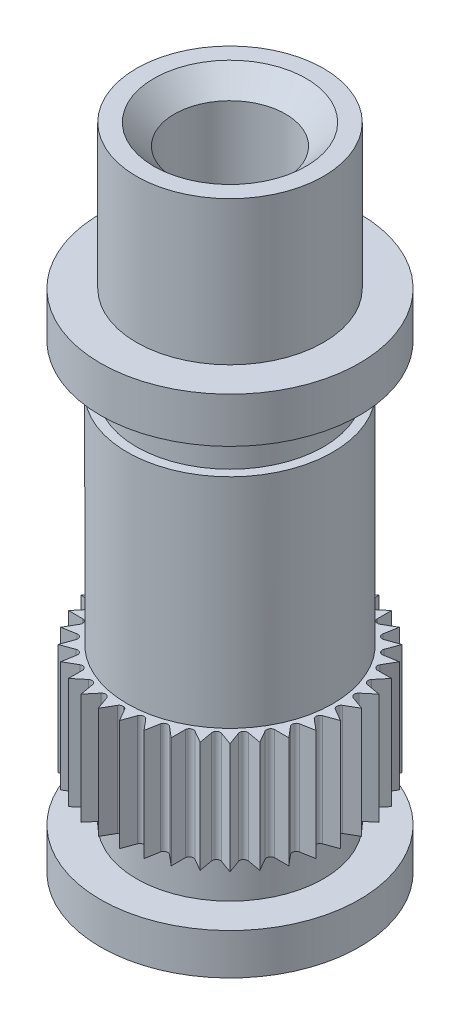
from build123d import *

# Parameters (mm, degrees)
BOSS_EXTRUDE1_DEPTH              = 2.7
F_36_0_1065_DIAMETER_HOLE1_D     = 2.7051
F_36_0_1065_DIAMETER_HOLE1_DEPTH = 9.525
F_36_0_1065_DIAMETER_HOLE1_TIP   = 0.81269403
CHAMFER1_SIZE                    = 0.500050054


with BuildPart() as part:
    # Sketch1 → Boss-Extrude1 (new body)
    with BuildSketch(Plane.XZ.offset(-2.1)):
        with BuildLine():
            Line((0.08660254, -2.65), (0.257785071, -2.94649684))
            Line((0.257785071, -2.94649684), (0.374880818, -2.624778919))
            ThreePointArc((0.374880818, -2.624778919), (0.451485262, -2.560500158), (0.545454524, -2.594702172))
            Line((0.545454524, -2.594702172), (0.765522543, -2.856969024))
            Line((0.765522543, -2.856969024), (0.824973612, -2.519805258))
            ThreePointArc((0.824973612, -2.519805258), (0.889252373, -2.443200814), (0.987733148, -2.460565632))
            Line((0.987733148, -2.460565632), (1.25, -2.680633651))
            Line((1.25, -2.680633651), (1.25, -2.33826859))
            ThreePointArc((1.25, -2.33826859), (1.3, -2.25166605), (1.4, -2.25166605))
            Line((1.4, -2.25166605), (1.69649684, -2.42284858))
            Line((1.69649684, -2.42284858), (1.637045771, -2.085684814))
            ThreePointArc((1.637045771, -2.085684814), (1.671247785, -1.991715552), (1.76972856, -1.974350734))
            Line((1.76972856, -1.974350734), (2.091446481, -2.091446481))
            Line((2.091446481, -2.091446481), (1.974350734, -1.76972856))
            ThreePointArc((1.974350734, -1.76972856), (1.991715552, -1.671247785), (2.085684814, -1.637045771))
            Line((2.085684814, -1.637045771), (2.42284858, -1.69649684))
            Line((2.42284858, -1.69649684), (2.25166605, -1.4))
            ThreePointArc((2.25166605, -1.4), (2.25166605, -1.3), (2.33826859, -1.25))
            Line((2.33826859, -1.25), (2.680633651, -1.25))
            Line((2.680633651, -1.25), (2.460565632, -0.987733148))
            ThreePointArc((2.460565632, -0.987733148), (2.443200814, -0.889252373), (2.519805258, -0.824973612))
            Line((2.519805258, -0.824973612), (2.856969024, -0.765522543))
            Line((2.856969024, -0.765522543), (2.594702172, -0.545454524))
            ThreePointArc((2.594702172, -0.545454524), (2.560500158, -0.451485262), (2.624778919, -0.374880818))
            Line((2.624778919, -0.374880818), (2.94649684, -0.257785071))
            Line((2.94649684, -0.257785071), (2.65, -0.08660254))
            ThreePointArc((2.65, -0.08660254), (2.6, 0), (2.65, 0.08660254))
            Line((2.65, 0.08660254), (2.94649684, 0.257785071))
            Line((2.94649684, 0.257785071), (2.624778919, 0.374880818))
            ThreePointArc((2.624778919, 0.374880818), (2.560500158, 0.451485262), (2.594702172, 0.545454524))
            Line((2.594702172, 0.545454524), (2.856969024, 0.765522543))
            Line((2.856969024, 0.765522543), (2.519805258, 0.824973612))
            ThreePointArc((2.519805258, 0.824973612), (2.443200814, 0.889252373), (2.460565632, 0.987733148))
            Line((2.460565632, 0.987733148), (2.680633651, 1.25))
            Line((2.680633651, 1.25), (2.33826859, 1.25))
            ThreePointArc((2.33826859, 1.25), (2.25166605, 1.3), (2.25166605, 1.4))
            Line((2.25166605, 1.4), (2.42284858, 1.69649684))
            Line((2.42284858, 1.69649684), (2.085684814, 1.637045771))
            ThreePointArc((2.085684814, 1.637045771), (1.991715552, 1.671247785), (1.974350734, 1.76972856))
            Line((1.974350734, 1.76972856), (2.091446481, 2.091446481))
            Line((2.091446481, 2.091446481), (1.76972856, 1.974350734))
            ThreePointArc((1.76972856, 1.974350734), (1.671247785, 1.991715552), (1.637045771, 2.085684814))
            Line((1.637045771, 2.085684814), (1.69649684, 2.42284858))
            Line((1.69649684, 2.42284858), (1.4, 2.25166605))
            ThreePointArc((1.4, 2.25166605), (1.3, 2.25166605), (1.25, 2.33826859))
            Line((1.25, 2.33826859), (1.25, 2.680633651))
            Line((1.25, 2.680633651), (0.987733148, 2.460565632))
            ThreePointArc((0.987733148, 2.460565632), (0.889252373, 2.443200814), (0.824973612, 2.519805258))
            Line((0.824973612, 2.519805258), (0.765522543, 2.856969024))
            Line((0.765522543, 2.856969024), (0.545454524, 2.594702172))
            ThreePointArc((0.545454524, 2.594702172), (0.451485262, 2.560500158), (0.374880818, 2.624778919))
            Line((0.374880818, 2.624778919), (0.257785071, 2.94649684))
            Line((0.257785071, 2.94649684), (0.08660254, 2.65))
            ThreePointArc((0.08660254, 2.65), (0, 2.6), (-0.08660254, 2.65))
            Line((-0.08660254, 2.65), (-0.257785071, 2.94649684))
            Line((-0.257785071, 2.94649684), (-0.374880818, 2.624778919))
            ThreePointArc((-0.374880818, 2.624778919), (-0.451485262, 2.560500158), (-0.545454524, 2.594702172))
            Line((-0.545454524, 2.594702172), (-0.765522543, 2.856969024))
            Line((-0.765522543, 2.856969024), (-0.824973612, 2.519805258))
            ThreePointArc((-0.824973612, 2.519805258), (-0.889252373, 2.443200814), (-0.987733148, 2.460565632))
            Line((-0.987733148, 2.460565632), (-1.25, 2.680633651))
            Line((-1.25, 2.680633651), (-1.25, 2.33826859))
            ThreePointArc((-1.25, 2.33826859), (-1.3, 2.25166605), (-1.4, 2.25166605))
            Line((-1.4, 2.25166605), (-1.69649684, 2.42284858))
            Line((-1.69649684, 2.42284858), (-1.637045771, 2.085684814))
            ThreePointArc((-1.637045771, 2.085684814), (-1.671247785, 1.991715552), (-1.76972856, 1.974350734))
            Line((-1.76972856, 1.974350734), (-2.091446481, 2.091446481))
            Line((-2.091446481, 2.091446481), (-1.974350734, 1.76972856))
            ThreePointArc((-1.974350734, 1.76972856), (-1.991715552, 1.671247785), (-2.085684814, 1.637045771))
            Line((-2.085684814, 1.637045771), (-2.42284858, 1.69649684))
            Line((-2.42284858, 1.69649684), (-2.25166605, 1.4))
            ThreePointArc((-2.25166605, 1.4), (-2.25166605, 1.3), (-2.33826859, 1.25))
            Line((-2.33826859, 1.25), (-2.680633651, 1.25))
            Line((-2.680633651, 1.25), (-2.460565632, 0.987733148))
            ThreePointArc((-2.460565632, 0.987733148), (-2.443200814, 0.889252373), (-2.519805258, 0.824973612))
            Line((-2.519805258, 0.824973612), (-2.856969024, 0.765522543))
            Line((-2.856969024, 0.765522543), (-2.594702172, 0.545454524))
            ThreePointArc((-2.594702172, 0.545454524), (-2.560500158, 0.451485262), (-2.624778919, 0.374880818))
            Line((-2.624778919, 0.374880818), (-2.94649684, 0.257785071))
            Line((-2.94649684, 0.257785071), (-2.65, 0.08660254))
            ThreePointArc((-2.65, 0.08660254), (-2.6, 0), (-2.65, -0.08660254))
            Line((-2.65, -0.08660254), (-2.94649684, -0.257785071))
            Line((-2.94649684, -0.257785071), (-2.624778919, -0.374880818))
            ThreePointArc((-2.624778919, -0.374880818), (-2.560500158, -0.451485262), (-2.594702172, -0.545454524))
            Line((-2.594702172, -0.545454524), (-2.856969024, -0.765522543))
            Line((-2.856969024, -0.765522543), (-2.519805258, -0.824973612))
            ThreePointArc((-2.519805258, -0.824973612), (-2.443200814, -0.889252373), (-2.460565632, -0.987733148))
            Line((-2.460565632, -0.987733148), (-2.680633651, -1.25))
            Line((-2.680633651, -1.25), (-2.33826859, -1.25))
            ThreePointArc((-2.33826859, -1.25), (-2.25166605, -1.3), (-2.25166605, -1.4))
            Line((-2.25166605, -1.4), (-2.42284858, -1.69649684))
            Line((-2.42284858, -1.69649684), (-2.085684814, -1.637045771))
            ThreePointArc((-2.085684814, -1.637045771), (-1.991715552, -1.671247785), (-1.974350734, -1.76972856))
            Line((-1.974350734, -1.76972856), (-2.091446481, -2.091446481))
            Line((-2.091446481, -2.091446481), (-1.76972856, -1.974350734))
            ThreePointArc((-1.76972856, -1.974350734), (-1.671247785, -1.991715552), (-1.637045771, -2.085684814))
            Line((-1.637045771, -2.085684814), (-1.69649684, -2.42284858))
            Line((-1.69649684, -2.42284858), (-1.4, -2.25166605))
            ThreePointArc((-1.4, -2.25166605), (-1.3, -2.25166605), (-1.25, -2.33826859))
            Line((-1.25, -2.33826859), (-1.25, -2.680633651))
            Line((-1.25, -2.680633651), (-0.987733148, -2.460565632))
            ThreePointArc((-0.987733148, -2.460565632), (-0.889252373, -2.443200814), (-0.824973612, -2.519805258))
            Line((-0.824973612, -2.519805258), (-0.765522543, -2.856969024))
            Line((-0.765522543, -2.856969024), (-0.545454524, -2.594702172))
            ThreePointArc((-0.545454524, -2.594702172), (-0.451485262, -2.560500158), (-0.374880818, -2.624778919))
            Line((-0.374880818, -2.624778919), (-0.257785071, -2.94649684))
            Line((-0.257785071, -2.94649684), (-0.08660254, -2.65))
            ThreePointArc((-0.08660254, -2.65), (0, -2.6), (0.08660254, -2.65))
        make_face()
    extrude(amount=-BOSS_EXTRUDE1_DEPTH)

    # Sketch2 → Revolve1 (revolve)
    with BuildSketch(Plane.XY, mode=Mode.PRIVATE) as revolve1_sk:
        Polygon((2.275, 15.8), (0, 15.8), (0, 4.8), (2.5, 4.8), (2.5, 10.1), (2.275, 10.1), (2.275, 11.2), (3.15, 11.2), (3.15, 12.3), (2.275, 12.3), align=None)
    revolve(revolve1_sk.sketch.rotate(Axis((0, 15.8, 0), (0, -1, 0)), 270), axis=Axis((0, 15.8, 0), (0, -1, 0)))

    # Sketch3 → Revolve2 (revolve)
    with BuildSketch(Plane(origin=(0, 0, 0), x_dir=(-1, 0, 0), z_dir=(0, 0, -1)), mode=Mode.PRIVATE) as revolve2_sk:
        Polygon((-3.15, 0), (0, 0), (0, 2.1), (-2.275, 2.1), (-2.275, 1), (-3.15, 1), align=None)
    revolve(revolve2_sk.sketch.rotate(Axis((0, 0, 0), (0, 1, 0)), 270), axis=Axis((0, 0, 0), (0, 1, 0)))

    # 36 _0.1065_ Diameter Hole1
    with Locations(Plane(origin=(0, 15.8, 0), x_dir=(1, 0, 0), z_dir=(0, 1, 0))):
        with Locations((0, 0)):
            Hole(F_36_0_1065_DIAMETER_HOLE1_D / 2, depth=F_36_0_1065_DIAMETER_HOLE1_DEPTH)
            with Locations((0, 0, -(F_36_0_1065_DIAMETER_HOLE1_DEPTH + F_36_0_1065_DIAMETER_HOLE1_TIP / 2))):  # 118° drill point
                Cone(0, F_36_0_1065_DIAMETER_HOLE1_D / 2, F_36_0_1065_DIAMETER_HOLE1_TIP, mode=Mode.SUBTRACT)

    # Chamfer1
    chamfer1_edges = [part.edges().sort_by_distance(p)[0] for p in [
        (1.35255, 15.8, 0),
    ]]
    chamfer(chamfer1_edges, length=CHAMFER1_SIZE)


solid = part.part
